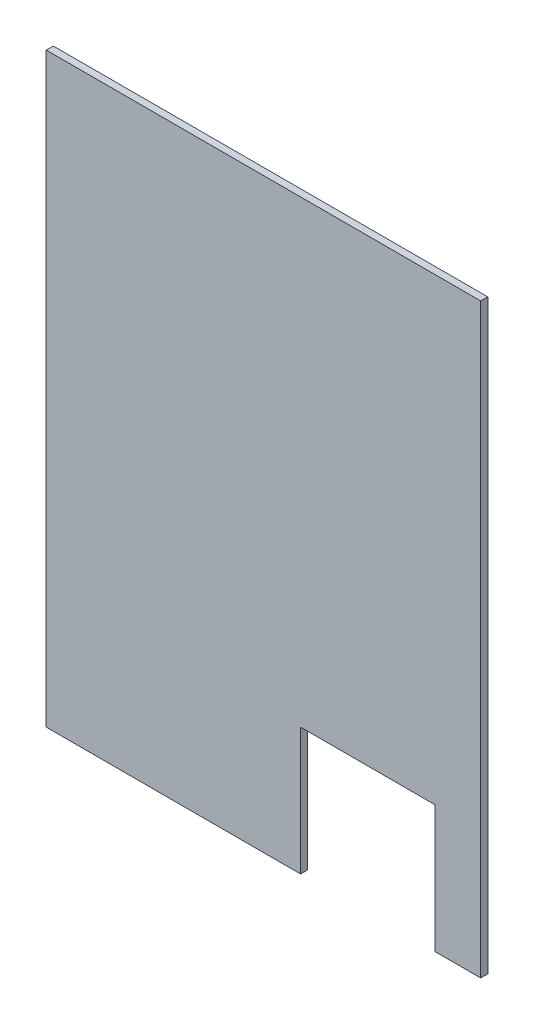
from build123d import *

# Parameters (mm, degrees)
EXTRUSION1_DEPTH = 10


with BuildPart() as part:
    # Esquisse1 → Extrusion1 (new body)
    with BuildSketch(Plane.XY):
        Polygon((0, 0), (360, 0), (360, 180), (550, 180), (550, 0), (615, 0), (615, 830), (0, 830), align=None)
    extrude(amount=EXTRUSION1_DEPTH)


solid = part.part
